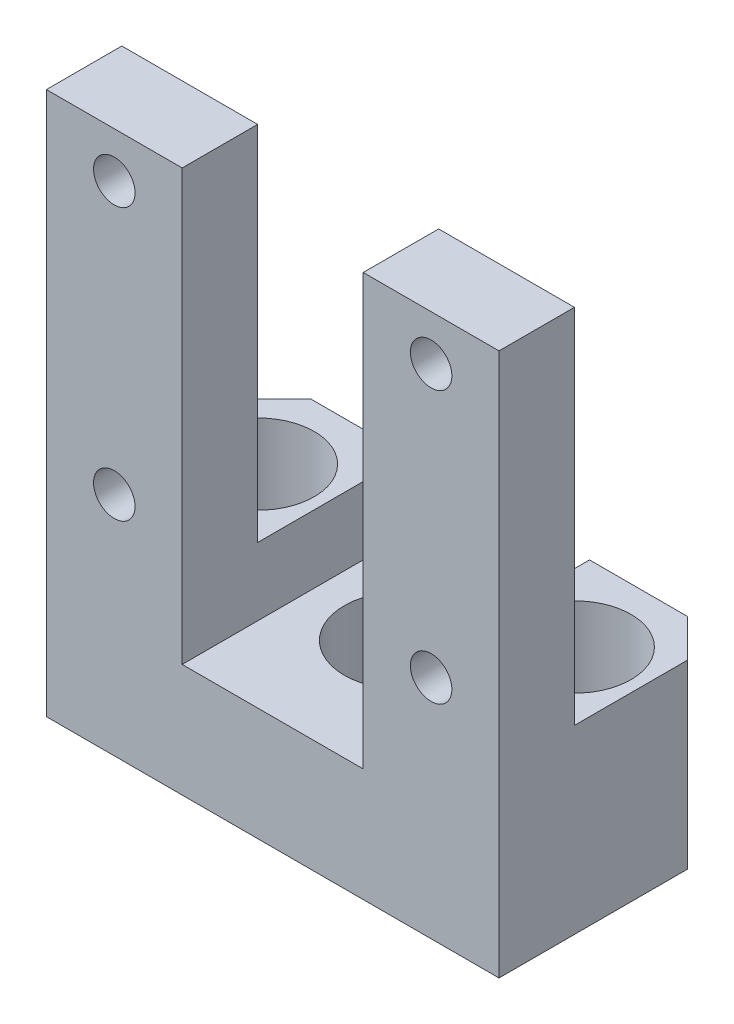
ISO-10303-21;
HEADER;
FILE_DESCRIPTION(('STEP AP214'),'2;1');
FILE_NAME('part.step','',(''),(''),'','','');
FILE_SCHEMA(('AUTOMOTIVE_DESIGN { 1 0 10303 214 1 1 1 1 }'));
ENDSEC;
DATA;
#1=APPLICATION_CONTEXT('core data for automotive mechanical design processes');
#2=APPLICATION_PROTOCOL_DEFINITION('international standard','automotive_design',2000,#1);
#3=PRODUCT_CONTEXT('',#1,'mechanical');
#4=PRODUCT('Part','Part','',(#3));
#5=PRODUCT_RELATED_PRODUCT_CATEGORY('part','',(#4));
#6=PRODUCT_DEFINITION_FORMATION('','',#4);
#7=PRODUCT_DEFINITION_CONTEXT('part definition',#1,'design');
#8=PRODUCT_DEFINITION('design','',#6,#7);
#9=PRODUCT_DEFINITION_SHAPE('','',#8);
#10=(LENGTH_UNIT() NAMED_UNIT(*) SI_UNIT(.MILLI.,.METRE.));
#11=(NAMED_UNIT(*) PLANE_ANGLE_UNIT() SI_UNIT($,.RADIAN.));
#12=(NAMED_UNIT(*) SI_UNIT($,.STERADIAN.) SOLID_ANGLE_UNIT());
#13=UNCERTAINTY_MEASURE_WITH_UNIT(LENGTH_MEASURE(1.E-05),#10,'distance_accuracy_value','');
#14=(GEOMETRIC_REPRESENTATION_CONTEXT(3) GLOBAL_UNCERTAINTY_ASSIGNED_CONTEXT((#13)) GLOBAL_UNIT_ASSIGNED_CONTEXT((#10,
#11,#12)) REPRESENTATION_CONTEXT('',''));
#15=CARTESIAN_POINT('',(0.,0.,0.));
#16=DIRECTION('',(0.,0.,1.));
#17=DIRECTION('',(1.,0.,0.));
#18=AXIS2_PLACEMENT_3D('',#15,#16,#17);
#19=CARTESIAN_POINT('',(21.,30.,12.5));
#20=DIRECTION('',(0.,0.,-1.));
#21=DIRECTION('',(0.,1.,0.));
#22=AXIS2_PLACEMENT_3D('',#19,#20,#21);
#23=CYLINDRICAL_SURFACE('',#22,5.);
#24=CARTESIAN_POINT('',(21.,30.,12.5));
#25=DIRECTION('',(0.,0.,-1.));
#26=DIRECTION('',(0.,1.,0.));
#27=AXIS2_PLACEMENT_3D('',#24,#25,#26);
#28=CIRCLE('',#27,5.);
#29=CARTESIAN_POINT('',(21.,35.,12.5));
#30=VERTEX_POINT('',#29);
#31=EDGE_CURVE('E603',#30,#30,#28,.T.);
#32=ORIENTED_EDGE('',*,*,#31,.F.);
#33=EDGE_LOOP('',(#32));
#34=FACE_BOUND('',#33,.T.);
#35=CARTESIAN_POINT('',(21.,30.,7.49999999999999));
#36=DIRECTION('',(0.,0.,-1.));
#37=DIRECTION('',(0.,1.,0.));
#38=AXIS2_PLACEMENT_3D('',#35,#36,#37);
#39=CIRCLE('',#38,5.);
#40=CARTESIAN_POINT('',(21.,35.,7.49999999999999));
#41=VERTEX_POINT('',#40);
#42=EDGE_CURVE('E610',#41,#41,#39,.T.);
#43=ORIENTED_EDGE('',*,*,#42,.T.);
#44=EDGE_LOOP('',(#43));
#45=FACE_BOUND('',#44,.T.);
#46=ADVANCED_FACE('F17',(#34,#45),#23,.F.);
#47=CARTESIAN_POINT('',(21.,66.,12.5));
#48=DIRECTION('',(0.,0.,-1.));
#49=DIRECTION('',(0.,1.,0.));
#50=AXIS2_PLACEMENT_3D('',#47,#48,#49);
#51=CYLINDRICAL_SURFACE('',#50,5.);
#52=CARTESIAN_POINT('',(21.,66.,12.5));
#53=DIRECTION('',(0.,0.,-1.));
#54=DIRECTION('',(0.,1.,0.));
#55=AXIS2_PLACEMENT_3D('',#52,#53,#54);
#56=CIRCLE('',#55,5.);
#57=CARTESIAN_POINT('',(21.,71.,12.5));
#58=VERTEX_POINT('',#57);
#59=EDGE_CURVE('E605',#58,#58,#56,.T.);
#60=ORIENTED_EDGE('',*,*,#59,.F.);
#61=EDGE_LOOP('',(#60));
#62=FACE_BOUND('',#61,.T.);
#63=CARTESIAN_POINT('',(21.,66.,7.5));
#64=DIRECTION('',(0.,0.,-1.));
#65=DIRECTION('',(0.,1.,0.));
#66=AXIS2_PLACEMENT_3D('',#63,#64,#65);
#67=CIRCLE('',#66,5.);
#68=CARTESIAN_POINT('',(21.,71.,7.5));
#69=VERTEX_POINT('',#68);
#70=EDGE_CURVE('E155',#69,#69,#67,.T.);
#71=ORIENTED_EDGE('',*,*,#70,.T.);
#72=EDGE_LOOP('',(#71));
#73=FACE_BOUND('',#72,.T.);
#74=ADVANCED_FACE('F244',(#62,#73),#51,.F.);
#75=CARTESIAN_POINT('',(21.,12.,-12.5));
#76=DIRECTION('',(0.,0.,-1.));
#77=DIRECTION('',(-1.,0.,0.));
#78=AXIS2_PLACEMENT_3D('',#75,#76,#77);
#79=CYLINDRICAL_SURFACE('',#78,1.65);
#80=CARTESIAN_POINT('',(21.,10.35,-9.));
#81=CARTESIAN_POINT('',(21.0914767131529,10.3500039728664,-8.99999786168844));
#82=CARTESIAN_POINT('',(21.1830077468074,10.3576347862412,-8.99830893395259));
#83=CARTESIAN_POINT('',(21.3634874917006,10.3879308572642,-8.99173252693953));
#84=CARTESIAN_POINT('',(21.4524335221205,10.4106111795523,-8.98684184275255));
#85=CARTESIAN_POINT('',(21.6250824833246,10.4702608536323,-8.97440674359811));
#86=CARTESIAN_POINT('',(21.7087913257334,10.507213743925,-8.96686538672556));
#87=CARTESIAN_POINT('',(21.8688098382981,10.5943082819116,-8.94994307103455));
#88=CARTESIAN_POINT('',(21.9451203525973,10.6444484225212,-8.94056232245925));
#89=CARTESIAN_POINT('',(22.0894219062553,10.7573522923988,-8.92081847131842));
#90=CARTESIAN_POINT('',(22.1572764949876,10.8202882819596,-8.91044311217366));
#91=CARTESIAN_POINT('',(22.2815709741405,10.9566455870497,-8.88996306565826));
#92=CARTESIAN_POINT('',(22.3380074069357,11.0300700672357,-8.87985846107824));
#93=CARTESIAN_POINT('',(22.4384710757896,11.1863469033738,-8.86094096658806));
#94=CARTESIAN_POINT('',(22.4823466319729,11.2692988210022,-8.85214443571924));
#95=CARTESIAN_POINT('',(22.5554385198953,11.4415691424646,-8.8370305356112));
#96=CARTESIAN_POINT('',(22.5846717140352,11.5308800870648,-8.83071031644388));
#97=CARTESIAN_POINT('',(22.6206823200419,11.6838780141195,-8.82281368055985));
#98=CARTESIAN_POINT('',(22.6316585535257,11.7465639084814,-8.82036523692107));
#99=CARTESIAN_POINT('',(22.6463186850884,11.8728244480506,-8.81708212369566));
#100=CARTESIAN_POINT('',(22.650002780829,11.9363990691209,-8.81624741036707));
#101=CARTESIAN_POINT('',(22.6499960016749,12.0914465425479,-8.81625138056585));
#102=CARTESIAN_POINT('',(22.642370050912,12.182947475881,-8.81798270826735));
#103=CARTESIAN_POINT('',(22.6120950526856,12.3633646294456,-8.82471024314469));
#104=CARTESIAN_POINT('',(22.5894308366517,12.4522781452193,-8.82970974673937));
#105=CARTESIAN_POINT('',(22.5298282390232,12.6248582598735,-8.84238018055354));
#106=CARTESIAN_POINT('',(22.4929070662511,12.7085310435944,-8.85004788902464));
#107=CARTESIAN_POINT('',(22.4058873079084,12.8684886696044,-8.86718660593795));
#108=CARTESIAN_POINT('',(22.355790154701,12.9447743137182,-8.87665741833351));
#109=CARTESIAN_POINT('',(22.2429305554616,13.0891019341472,-8.89651594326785));
#110=CARTESIAN_POINT('',(22.1799861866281,13.157000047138,-8.90691546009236));
#111=CARTESIAN_POINT('',(22.0435935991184,13.2813791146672,-8.92735880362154));
#112=CARTESIAN_POINT('',(21.9701423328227,13.3378567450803,-8.9374025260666));
#113=CARTESIAN_POINT('',(21.8138400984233,13.4383651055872,-8.95613323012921));
#114=CARTESIAN_POINT('',(21.7308941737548,13.4822512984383,-8.96480398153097));
#115=CARTESIAN_POINT('',(21.5586367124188,13.5553645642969,-8.97966356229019));
#116=CARTESIAN_POINT('',(21.4693325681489,13.5846083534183,-8.9858552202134));
#117=CARTESIAN_POINT('',(21.3163067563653,13.6206478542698,-8.99358442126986));
#118=CARTESIAN_POINT('',(21.2535837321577,13.6316370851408,-8.9959781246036));
#119=CARTESIAN_POINT('',(21.1272492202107,13.64631444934,-8.99918663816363));
#120=CARTESIAN_POINT('',(21.0636377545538,13.6500027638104,-9.0000014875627));
#121=CARTESIAN_POINT('',(20.9085232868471,13.6499960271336,-8.99999786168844));
#122=CARTESIAN_POINT('',(20.8169922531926,13.6423652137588,-8.99830893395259));
#123=CARTESIAN_POINT('',(20.6365125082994,13.6120691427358,-8.99173252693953));
#124=CARTESIAN_POINT('',(20.5475664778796,13.5893888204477,-8.98684184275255));
#125=CARTESIAN_POINT('',(20.3749175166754,13.5297391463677,-8.97440674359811));
#126=CARTESIAN_POINT('',(20.2912086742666,13.492786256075,-8.96686538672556));
#127=CARTESIAN_POINT('',(20.1311901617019,13.4056917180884,-8.94994307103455));
#128=CARTESIAN_POINT('',(20.0548796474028,13.3555515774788,-8.94056232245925));
#129=CARTESIAN_POINT('',(19.9105780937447,13.2426477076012,-8.92081847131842));
#130=CARTESIAN_POINT('',(19.8427235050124,13.1797117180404,-8.91044311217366));
#131=CARTESIAN_POINT('',(19.7184290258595,13.0433544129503,-8.88996306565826));
#132=CARTESIAN_POINT('',(19.6619925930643,12.9699299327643,-8.87985846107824));
#133=CARTESIAN_POINT('',(19.5615289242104,12.8136530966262,-8.86094096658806));
#134=CARTESIAN_POINT('',(19.5176533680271,12.7307011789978,-8.85214443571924));
#135=CARTESIAN_POINT('',(19.4445614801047,12.5584308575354,-8.8370305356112));
#136=CARTESIAN_POINT('',(19.4153282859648,12.4691199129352,-8.83071031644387));
#137=CARTESIAN_POINT('',(19.3793176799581,12.3161219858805,-8.82281368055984));
#138=CARTESIAN_POINT('',(19.3683414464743,12.2534360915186,-8.82036523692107));
#139=CARTESIAN_POINT('',(19.3536813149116,12.1271755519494,-8.81708212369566));
#140=CARTESIAN_POINT('',(19.349997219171,12.0636009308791,-8.81624741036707));
#141=CARTESIAN_POINT('',(19.3500039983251,11.9085534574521,-8.81625138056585));
#142=CARTESIAN_POINT('',(19.357629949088,11.817052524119,-8.81798270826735));
#143=CARTESIAN_POINT('',(19.3879049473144,11.6366353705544,-8.82471024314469));
#144=CARTESIAN_POINT('',(19.4105691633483,11.5477218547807,-8.82970974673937));
#145=CARTESIAN_POINT('',(19.4701717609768,11.3751417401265,-8.84238018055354));
#146=CARTESIAN_POINT('',(19.5070929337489,11.2914689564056,-8.85004788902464));
#147=CARTESIAN_POINT('',(19.5941126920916,11.1315113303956,-8.86718660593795));
#148=CARTESIAN_POINT('',(19.644209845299,11.0552256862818,-8.87665741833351));
#149=CARTESIAN_POINT('',(19.7570694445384,10.9108980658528,-8.89651594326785));
#150=CARTESIAN_POINT('',(19.8200138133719,10.842999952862,-8.90691546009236));
#151=CARTESIAN_POINT('',(19.9564064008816,10.7186208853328,-8.92735880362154));
#152=CARTESIAN_POINT('',(20.0298576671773,10.6621432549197,-8.9374025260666));
#153=CARTESIAN_POINT('',(20.1861599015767,10.5616348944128,-8.95613323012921));
#154=CARTESIAN_POINT('',(20.2691058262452,10.5177487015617,-8.96480398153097));
#155=CARTESIAN_POINT('',(20.4413632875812,10.4446354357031,-8.97966356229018));
#156=CARTESIAN_POINT('',(20.5306674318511,10.4153916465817,-8.9858552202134));
#157=CARTESIAN_POINT('',(20.6836932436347,10.3793521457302,-8.99358442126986));
#158=CARTESIAN_POINT('',(20.7464162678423,10.3683629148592,-8.9959781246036));
#159=CARTESIAN_POINT('',(20.8727507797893,10.35368555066,-8.99918663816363));
#160=CARTESIAN_POINT('',(20.9363622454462,10.3499972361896,-9.0000014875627));
#161=CARTESIAN_POINT('',(21.,10.35,-9.));
#162=B_SPLINE_CURVE_WITH_KNOTS('',3,(#80,#81,#82,#83,#84,#85,#86,#87,#88,#89,#90,#91,#92,#93,
#94,#95,#96,#97,#98,#99,#100,#101,#102,#103,#104,#105,#106,#107,#108,#109,#110,#111,#112,#113,
#114,#115,#116,#117,#118,#119,#120,#121,#122,#123,#124,#125,#126,#127,#128,#129,#130,#131,#132,
#133,#134,#135,#136,#137,#138,#139,#140,#141,#142,#143,#144,#145,#146,#147,#148,#149,#150,#151,
#152,#153,#154,#155,#156,#157,#158,#159,#160,#161),.UNSPECIFIED.,.T.,.F.,(4,2,2,2,2,2,2,2,2,2,2,
2,2,2,2,2,2,2,2,2,2,2,2,2,2,2,2,2,2,2,2,2,2,2,2,2,2,2,2,2,4),(0.,0.274195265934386,
0.548665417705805,0.822819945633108,1.09694315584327,1.37503526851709,1.6532114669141,
1.93461732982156,2.21569837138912,2.40634286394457,2.59698218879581,2.87108677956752,
3.14546827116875,3.41951960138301,3.69354115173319,3.97175205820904,4.25004382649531,
4.53141281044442,4.81245984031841,5.00321444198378,5.19396431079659,5.46815957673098,
5.7426297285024,6.0167842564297,6.29090746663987,6.56899957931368,6.8471757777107,
7.12858164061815,7.40966268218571,7.60030717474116,7.79094649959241,8.06505109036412,
8.33943258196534,8.61348391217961,8.88750546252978,9.16571636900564,9.44400813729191,
9.72537712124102,10.006424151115,10.1971787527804,10.3879286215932),.UNSPECIFIED.);
#163=CARTESIAN_POINT('',(21.,10.35,-9.));
#164=VERTEX_POINT('',#163);
#165=EDGE_CURVE('E154',#164,#164,#162,.T.);
#166=ORIENTED_EDGE('',*,*,#165,.T.);
#167=EDGE_LOOP('',(#166));
#168=FACE_BOUND('',#167,.T.);
#169=CARTESIAN_POINT('',(21.,12.,-12.5));
#170=DIRECTION('',(0.,0.,-1.));
#171=DIRECTION('',(-1.,0.,0.));
#172=AXIS2_PLACEMENT_3D('',#169,#170,#171);
#173=CIRCLE('',#172,1.65);
#174=CARTESIAN_POINT('',(19.35,12.,-12.5));
#175=VERTEX_POINT('',#174);
#176=EDGE_CURVE('E130',#175,#175,#173,.T.);
#177=ORIENTED_EDGE('',*,*,#176,.T.);
#178=EDGE_LOOP('',(#177));
#179=FACE_BOUND('',#178,.T.);
#180=ADVANCED_FACE('F241',(#168,#179),#79,.F.);
#181=CARTESIAN_POINT('',(-21.,12.,-12.5));
#182=DIRECTION('',(0.,0.,-1.));
#183=DIRECTION('',(-1.,0.,0.));
#184=AXIS2_PLACEMENT_3D('',#181,#182,#183);
#185=CYLINDRICAL_SURFACE('',#184,1.65);
#186=CARTESIAN_POINT('',(-21.,10.35,-9.));
#187=CARTESIAN_POINT('',(-20.9085232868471,10.3500039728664,-8.99999786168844));
#188=CARTESIAN_POINT('',(-20.8169922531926,10.3576347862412,-8.99830893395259));
#189=CARTESIAN_POINT('',(-20.6365125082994,10.3879308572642,-8.99173252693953));
#190=CARTESIAN_POINT('',(-20.5475664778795,10.4106111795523,-8.98684184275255));
#191=CARTESIAN_POINT('',(-20.3749175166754,10.4702608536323,-8.97440674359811));
#192=CARTESIAN_POINT('',(-20.2912086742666,10.507213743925,-8.96686538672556));
#193=CARTESIAN_POINT('',(-20.1311901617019,10.5943082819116,-8.94994307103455));
#194=CARTESIAN_POINT('',(-20.0548796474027,10.6444484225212,-8.94056232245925));
#195=CARTESIAN_POINT('',(-19.9105780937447,10.7573522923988,-8.92081847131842));
#196=CARTESIAN_POINT('',(-19.8427235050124,10.8202882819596,-8.91044311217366));
#197=CARTESIAN_POINT('',(-19.7184290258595,10.9566455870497,-8.88996306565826));
#198=CARTESIAN_POINT('',(-19.6619925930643,11.0300700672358,-8.87985846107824));
#199=CARTESIAN_POINT('',(-19.5615289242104,11.1863469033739,-8.86094096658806));
#200=CARTESIAN_POINT('',(-19.5176533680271,11.2692988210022,-8.85214443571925));
#201=CARTESIAN_POINT('',(-19.4445614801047,11.4415691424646,-8.8370305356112));
#202=CARTESIAN_POINT('',(-19.4153282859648,11.5308800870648,-8.83071031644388));
#203=CARTESIAN_POINT('',(-19.3793176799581,11.6838780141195,-8.82281368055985));
#204=CARTESIAN_POINT('',(-19.3683414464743,11.7465639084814,-8.82036523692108));
#205=CARTESIAN_POINT('',(-19.3536813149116,11.8728244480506,-8.81708212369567));
#206=CARTESIAN_POINT('',(-19.349997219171,11.9363990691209,-8.81624741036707));
#207=CARTESIAN_POINT('',(-19.3500039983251,12.0914465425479,-8.81625138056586));
#208=CARTESIAN_POINT('',(-19.357629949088,12.182947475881,-8.81798270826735));
#209=CARTESIAN_POINT('',(-19.3879049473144,12.3633646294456,-8.82471024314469));
#210=CARTESIAN_POINT('',(-19.4105691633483,12.4522781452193,-8.82970974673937));
#211=CARTESIAN_POINT('',(-19.4701717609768,12.6248582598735,-8.84238018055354));
#212=CARTESIAN_POINT('',(-19.5070929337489,12.7085310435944,-8.85004788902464));
#213=CARTESIAN_POINT('',(-19.5941126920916,12.8684886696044,-8.86718660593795));
#214=CARTESIAN_POINT('',(-19.644209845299,12.9447743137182,-8.87665741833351));
#215=CARTESIAN_POINT('',(-19.7570694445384,13.0891019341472,-8.89651594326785));
#216=CARTESIAN_POINT('',(-19.8200138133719,13.157000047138,-8.90691546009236));
#217=CARTESIAN_POINT('',(-19.9564064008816,13.2813791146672,-8.92735880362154));
#218=CARTESIAN_POINT('',(-20.0298576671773,13.3378567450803,-8.9374025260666));
#219=CARTESIAN_POINT('',(-20.1861599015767,13.4383651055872,-8.95613323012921));
#220=CARTESIAN_POINT('',(-20.2691058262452,13.4822512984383,-8.96480398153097));
#221=CARTESIAN_POINT('',(-20.4413632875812,13.5553645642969,-8.97966356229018));
#222=CARTESIAN_POINT('',(-20.5306674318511,13.5846083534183,-8.9858552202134));
#223=CARTESIAN_POINT('',(-20.6836932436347,13.6206478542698,-8.99358442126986));
#224=CARTESIAN_POINT('',(-20.7464162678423,13.6316370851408,-8.9959781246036));
#225=CARTESIAN_POINT('',(-20.8727507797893,13.64631444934,-8.99918663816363));
#226=CARTESIAN_POINT('',(-20.9363622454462,13.6500027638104,-9.0000014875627));
#227=CARTESIAN_POINT('',(-21.0914767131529,13.6499960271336,-8.99999786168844));
#228=CARTESIAN_POINT('',(-21.1830077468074,13.6423652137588,-8.99830893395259));
#229=CARTESIAN_POINT('',(-21.3634874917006,13.6120691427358,-8.99173252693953));
#230=CARTESIAN_POINT('',(-21.4524335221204,13.5893888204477,-8.98684184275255));
#231=CARTESIAN_POINT('',(-21.6250824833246,13.5297391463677,-8.97440674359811));
#232=CARTESIAN_POINT('',(-21.7087913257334,13.492786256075,-8.96686538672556));
#233=CARTESIAN_POINT('',(-21.8688098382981,13.4056917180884,-8.94994307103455));
#234=CARTESIAN_POINT('',(-21.9451203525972,13.3555515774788,-8.94056232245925));
#235=CARTESIAN_POINT('',(-22.0894219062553,13.2426477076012,-8.92081847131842));
#236=CARTESIAN_POINT('',(-22.1572764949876,13.1797117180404,-8.91044311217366));
#237=CARTESIAN_POINT('',(-22.2815709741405,13.0433544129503,-8.88996306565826));
#238=CARTESIAN_POINT('',(-22.3380074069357,12.9699299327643,-8.87985846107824));
#239=CARTESIAN_POINT('',(-22.4384710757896,12.8136530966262,-8.86094096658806));
#240=CARTESIAN_POINT('',(-22.4823466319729,12.7307011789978,-8.85214443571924));
#241=CARTESIAN_POINT('',(-22.5554385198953,12.5584308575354,-8.8370305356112));
#242=CARTESIAN_POINT('',(-22.5846717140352,12.4691199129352,-8.83071031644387));
#243=CARTESIAN_POINT('',(-22.6206823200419,12.3161219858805,-8.82281368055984));
#244=CARTESIAN_POINT('',(-22.6316585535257,12.2534360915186,-8.82036523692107));
#245=CARTESIAN_POINT('',(-22.6463186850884,12.1271755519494,-8.81708212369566));
#246=CARTESIAN_POINT('',(-22.650002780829,12.0636009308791,-8.81624741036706));
#247=CARTESIAN_POINT('',(-22.6499960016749,11.9085534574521,-8.81625138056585));
#248=CARTESIAN_POINT('',(-22.642370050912,11.817052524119,-8.81798270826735));
#249=CARTESIAN_POINT('',(-22.6120950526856,11.6366353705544,-8.82471024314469));
#250=CARTESIAN_POINT('',(-22.5894308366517,11.5477218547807,-8.82970974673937));
#251=CARTESIAN_POINT('',(-22.5298282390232,11.3751417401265,-8.84238018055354));
#252=CARTESIAN_POINT('',(-22.4929070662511,11.2914689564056,-8.85004788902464));
#253=CARTESIAN_POINT('',(-22.4058873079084,11.1315113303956,-8.86718660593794));
#254=CARTESIAN_POINT('',(-22.355790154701,11.0552256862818,-8.87665741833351));
#255=CARTESIAN_POINT('',(-22.2429305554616,10.9108980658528,-8.89651594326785));
#256=CARTESIAN_POINT('',(-22.1799861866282,10.842999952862,-8.90691546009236));
#257=CARTESIAN_POINT('',(-22.0435935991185,10.7186208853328,-8.92735880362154));
#258=CARTESIAN_POINT('',(-21.9701423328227,10.6621432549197,-8.9374025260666));
#259=CARTESIAN_POINT('',(-21.8138400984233,10.5616348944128,-8.95613323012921));
#260=CARTESIAN_POINT('',(-21.7308941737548,10.5177487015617,-8.96480398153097));
#261=CARTESIAN_POINT('',(-21.5586367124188,10.4446354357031,-8.97966356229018));
#262=CARTESIAN_POINT('',(-21.4693325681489,10.4153916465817,-8.9858552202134));
#263=CARTESIAN_POINT('',(-21.3163067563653,10.3793521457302,-8.99358442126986));
#264=CARTESIAN_POINT('',(-21.2535837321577,10.3683629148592,-8.9959781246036));
#265=CARTESIAN_POINT('',(-21.1272492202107,10.35368555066,-8.99918663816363));
#266=CARTESIAN_POINT('',(-21.0636377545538,10.3499972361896,-9.0000014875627));
#267=CARTESIAN_POINT('',(-21.,10.35,-9.));
#268=B_SPLINE_CURVE_WITH_KNOTS('',3,(#186,#187,#188,#189,#190,#191,#192,#193,#194,#195,#196,
#197,#198,#199,#200,#201,#202,#203,#204,#205,#206,#207,#208,#209,#210,#211,#212,#213,#214,#215,
#216,#217,#218,#219,#220,#221,#222,#223,#224,#225,#226,#227,#228,#229,#230,#231,#232,#233,#234,
#235,#236,#237,#238,#239,#240,#241,#242,#243,#244,#245,#246,#247,#248,#249,#250,#251,#252,#253,
#254,#255,#256,#257,#258,#259,#260,#261,#262,#263,#264,#265,#266,#267),.UNSPECIFIED.,.T.,.F.,(4,
2,2,2,2,2,2,2,2,2,2,2,2,2,2,2,2,2,2,2,2,2,2,2,2,2,2,2,2,2,2,2,2,2,2,2,2,2,2,2,4),(0.,
0.274195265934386,0.548665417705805,0.822819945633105,1.09694315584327,1.37503526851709,
1.6532114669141,1.93461732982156,2.21569837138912,2.40634286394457,2.59698218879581,
2.87108677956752,3.14546827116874,3.419519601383,3.69354115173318,3.97175205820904,
4.25004382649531,4.53141281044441,4.81245984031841,5.00321444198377,5.19396431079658,
5.46815957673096,5.74262972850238,6.01678425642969,6.29090746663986,6.56899957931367,
6.84717577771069,7.12858164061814,7.4096626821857,7.60030717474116,7.7909464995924,
8.06505109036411,8.33943258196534,8.6134839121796,8.88750546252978,9.16571636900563,
9.4440081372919,9.72537712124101,10.006424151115,10.1971787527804,10.3879286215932),.UNSPECIFIED.);
#269=CARTESIAN_POINT('',(-21.,10.35,-9.));
#270=VERTEX_POINT('',#269);
#271=EDGE_CURVE('E131',#270,#270,#268,.T.);
#272=ORIENTED_EDGE('',*,*,#271,.T.);
#273=EDGE_LOOP('',(#272));
#274=FACE_BOUND('',#273,.T.);
#275=CARTESIAN_POINT('',(-21.,12.,-12.5));
#276=DIRECTION('',(0.,0.,-1.));
#277=DIRECTION('',(-1.,0.,0.));
#278=AXIS2_PLACEMENT_3D('',#275,#276,#277);
#279=CIRCLE('',#278,1.65);
#280=CARTESIAN_POINT('',(-22.65,12.,-12.5));
#281=VERTEX_POINT('',#280);
#282=EDGE_CURVE('E146',#281,#281,#279,.T.);
#283=ORIENTED_EDGE('',*,*,#282,.T.);
#284=EDGE_LOOP('',(#283));
#285=FACE_BOUND('',#284,.T.);
#286=ADVANCED_FACE('F218',(#274,#285),#185,.F.);
#287=CARTESIAN_POINT('',(-21.,66.,12.5));
#288=DIRECTION('',(0.,0.,-1.));
#289=DIRECTION('',(0.,1.,0.));
#290=AXIS2_PLACEMENT_3D('',#287,#288,#289);
#291=CYLINDRICAL_SURFACE('',#290,5.);
#292=CARTESIAN_POINT('',(-21.,66.,12.5));
#293=DIRECTION('',(0.,0.,-1.));
#294=DIRECTION('',(0.,1.,0.));
#295=AXIS2_PLACEMENT_3D('',#292,#293,#294);
#296=CIRCLE('',#295,5.);
#297=CARTESIAN_POINT('',(-21.,71.,12.5));
#298=VERTEX_POINT('',#297);
#299=EDGE_CURVE('E599',#298,#298,#296,.T.);
#300=ORIENTED_EDGE('',*,*,#299,.F.);
#301=EDGE_LOOP('',(#300));
#302=FACE_BOUND('',#301,.T.);
#303=CARTESIAN_POINT('',(-21.,66.,7.5));
#304=DIRECTION('',(0.,0.,-1.));
#305=DIRECTION('',(0.,1.,0.));
#306=AXIS2_PLACEMENT_3D('',#303,#304,#305);
#307=CIRCLE('',#306,5.);
#308=CARTESIAN_POINT('',(-21.,71.,7.5));
#309=VERTEX_POINT('',#308);
#310=EDGE_CURVE('E140',#309,#309,#307,.T.);
#311=ORIENTED_EDGE('',*,*,#310,.T.);
#312=EDGE_LOOP('',(#311));
#313=FACE_BOUND('',#312,.T.);
#314=ADVANCED_FACE('F397',(#302,#313),#291,.F.);
#315=CARTESIAN_POINT('',(-21.,30.,12.5));
#316=DIRECTION('',(0.,0.,-1.));
#317=DIRECTION('',(0.,1.,0.));
#318=AXIS2_PLACEMENT_3D('',#315,#316,#317);
#319=CYLINDRICAL_SURFACE('',#318,5.);
#320=CARTESIAN_POINT('',(-21.,30.,12.5));
#321=DIRECTION('',(0.,0.,-1.));
#322=DIRECTION('',(0.,1.,0.));
#323=AXIS2_PLACEMENT_3D('',#320,#321,#322);
#324=CIRCLE('',#323,5.);
#325=CARTESIAN_POINT('',(-21.,35.,12.5));
#326=VERTEX_POINT('',#325);
#327=EDGE_CURVE('E20',#326,#326,#324,.T.);
#328=ORIENTED_EDGE('',*,*,#327,.F.);
#329=EDGE_LOOP('',(#328));
#330=FACE_BOUND('',#329,.T.);
#331=CARTESIAN_POINT('',(-21.,30.,7.49999999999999));
#332=DIRECTION('',(0.,0.,-1.));
#333=DIRECTION('',(0.,1.,0.));
#334=AXIS2_PLACEMENT_3D('',#331,#332,#333);
#335=CIRCLE('',#334,5.);
#336=CARTESIAN_POINT('',(-21.,35.,7.49999999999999));
#337=VERTEX_POINT('',#336);
#338=EDGE_CURVE('E203',#337,#337,#335,.T.);
#339=ORIENTED_EDGE('',*,*,#338,.T.);
#340=EDGE_LOOP('',(#339));
#341=FACE_BOUND('',#340,.T.);
#342=ADVANCED_FACE('F389',(#330,#341),#319,.F.);
#343=CARTESIAN_POINT('',(-21.,30.,12.5));
#344=DIRECTION('',(0.,0.,-1.));
#345=DIRECTION('',(0.,1.,0.));
#346=AXIS2_PLACEMENT_3D('',#343,#344,#345);
#347=PLANE('',#346);
#348=CARTESIAN_POINT('',(-21.,30.,12.5));
#349=DIRECTION('',(0.,0.,-1.));
#350=DIRECTION('',(0.,1.,0.));
#351=AXIS2_PLACEMENT_3D('',#348,#349,#350);
#352=CIRCLE('',#351,2.75);
#353=CARTESIAN_POINT('',(-21.,32.75,12.5));
#354=VERTEX_POINT('',#353);
#355=EDGE_CURVE('E196',#354,#354,#352,.F.);
#356=ORIENTED_EDGE('',*,*,#355,.T.);
#357=EDGE_LOOP('',(#356));
#358=FACE_BOUND('',#357,.T.);
#359=ORIENTED_EDGE('',*,*,#327,.T.);
#360=EDGE_LOOP('',(#359));
#361=FACE_BOUND('',#360,.T.);
#362=ADVANCED_FACE('F381',(#358,#361),#347,.T.);
#363=CARTESIAN_POINT('',(-21.,66.,12.5));
#364=DIRECTION('',(0.,0.,-1.));
#365=DIRECTION('',(0.,1.,0.));
#366=AXIS2_PLACEMENT_3D('',#363,#364,#365);
#367=PLANE('',#366);
#368=CARTESIAN_POINT('',(-21.,66.,12.5));
#369=DIRECTION('',(0.,0.,-1.));
#370=DIRECTION('',(0.,1.,0.));
#371=AXIS2_PLACEMENT_3D('',#368,#369,#370);
#372=CIRCLE('',#371,2.75);
#373=CARTESIAN_POINT('',(-21.,68.75,12.5));
#374=VERTEX_POINT('',#373);
#375=EDGE_CURVE('E193',#374,#374,#372,.F.);
#376=ORIENTED_EDGE('',*,*,#375,.T.);
#377=EDGE_LOOP('',(#376));
#378=FACE_BOUND('',#377,.T.);
#379=ORIENTED_EDGE('',*,*,#299,.T.);
#380=EDGE_LOOP('',(#379));
#381=FACE_BOUND('',#380,.T.);
#382=ADVANCED_FACE('F373',(#378,#381),#367,.T.);
#383=CARTESIAN_POINT('',(21.,30.,12.5));
#384=DIRECTION('',(0.,0.,-1.));
#385=DIRECTION('',(0.,1.,0.));
#386=AXIS2_PLACEMENT_3D('',#383,#384,#385);
#387=PLANE('',#386);
#388=CARTESIAN_POINT('',(21.,30.,12.5));
#389=DIRECTION('',(0.,0.,-1.));
#390=DIRECTION('',(0.,1.,0.));
#391=AXIS2_PLACEMENT_3D('',#388,#389,#390);
#392=CIRCLE('',#391,2.75);
#393=CARTESIAN_POINT('',(21.,32.75,12.5));
#394=VERTEX_POINT('',#393);
#395=EDGE_CURVE('E190',#394,#394,#392,.F.);
#396=ORIENTED_EDGE('',*,*,#395,.T.);
#397=EDGE_LOOP('',(#396));
#398=FACE_BOUND('',#397,.T.);
#399=ORIENTED_EDGE('',*,*,#31,.T.);
#400=EDGE_LOOP('',(#399));
#401=FACE_BOUND('',#400,.T.);
#402=ADVANCED_FACE('F365',(#398,#401),#387,.T.);
#403=CARTESIAN_POINT('',(21.,66.,12.5));
#404=DIRECTION('',(0.,0.,-1.));
#405=DIRECTION('',(0.,1.,0.));
#406=AXIS2_PLACEMENT_3D('',#403,#404,#405);
#407=PLANE('',#406);
#408=CARTESIAN_POINT('',(21.,66.,12.5));
#409=DIRECTION('',(0.,0.,-1.));
#410=DIRECTION('',(0.,1.,0.));
#411=AXIS2_PLACEMENT_3D('',#408,#409,#410);
#412=CIRCLE('',#411,2.75);
#413=CARTESIAN_POINT('',(21.,68.75,12.5));
#414=VERTEX_POINT('',#413);
#415=EDGE_CURVE('E186',#414,#414,#412,.F.);
#416=ORIENTED_EDGE('',*,*,#415,.T.);
#417=EDGE_LOOP('',(#416));
#418=FACE_BOUND('',#417,.T.);
#419=ORIENTED_EDGE('',*,*,#59,.T.);
#420=EDGE_LOOP('',(#419));
#421=FACE_BOUND('',#420,.T.);
#422=ADVANCED_FACE('F357',(#418,#421),#407,.T.);
#423=CARTESIAN_POINT('',(-30.,72.,7.5));
#424=DIRECTION('',(0.,0.,1.));
#425=DIRECTION('',(0.,-1.,0.));
#426=AXIS2_PLACEMENT_3D('',#423,#424,#425);
#427=PLANE('',#426);
#428=DIRECTION('',(0.,1.,0.));
#429=VECTOR('',#428,1.);
#430=CARTESIAN_POINT('',(30.,72.,7.5));
#431=LINE('',#430,#429);
#432=CARTESIAN_POINT('',(30.,72.,7.5));
#433=VERTEX_POINT('',#432);
#434=CARTESIAN_POINT('',(30.,24.,7.5));
#435=VERTEX_POINT('',#434);
#436=EDGE_CURVE('E636',#433,#435,#431,.F.);
#437=ORIENTED_EDGE('',*,*,#436,.T.);
#438=DIRECTION('',(1.,0.,0.));
#439=VECTOR('',#438,1.);
#440=CARTESIAN_POINT('',(-30.,24.,7.49999999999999));
#441=LINE('',#440,#439);
#442=CARTESIAN_POINT('',(12.,24.,7.49999999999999));
#443=VERTEX_POINT('',#442);
#444=EDGE_CURVE('E152',#435,#443,#441,.F.);
#445=ORIENTED_EDGE('',*,*,#444,.T.);
#446=DIRECTION('',(0.,1.,0.));
#447=VECTOR('',#446,1.);
#448=CARTESIAN_POINT('',(12.,129.,7.49999999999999));
#449=LINE('',#448,#447);
#450=CARTESIAN_POINT('',(12.,72.,7.5));
#451=VERTEX_POINT('',#450);
#452=EDGE_CURVE('E650',#443,#451,#449,.T.);
#453=ORIENTED_EDGE('',*,*,#452,.T.);
#454=DIRECTION('',(1.,0.,0.));
#455=VECTOR('',#454,1.);
#456=CARTESIAN_POINT('',(0.,72.,7.5));
#457=LINE('',#456,#455);
#458=EDGE_CURVE('E639',#433,#451,#457,.F.);
#459=ORIENTED_EDGE('',*,*,#458,.F.);
#460=EDGE_LOOP('',(#437,#445,#453,#459));
#461=FACE_BOUND('',#460,.T.);
#462=ORIENTED_EDGE('',*,*,#70,.F.);
#463=EDGE_LOOP('',(#462));
#464=FACE_BOUND('',#463,.T.);
#465=ORIENTED_EDGE('',*,*,#42,.F.);
#466=EDGE_LOOP('',(#465));
#467=FACE_BOUND('',#466,.T.);
#468=ADVANCED_FACE('F350',(#461,#464,#467),#427,.F.);
#469=CARTESIAN_POINT('',(-30.,24.,-12.5));
#470=DIRECTION('',(0.,-1.,0.));
#471=DIRECTION('',(0.,0.,-1.));
#472=AXIS2_PLACEMENT_3D('',#469,#470,#471);
#473=PLANE('',#472);
#474=CARTESIAN_POINT('',(21.,24.,-1.5));
#475=DIRECTION('',(0.,1.,0.));
#476=DIRECTION('',(0.,0.,1.));
#477=AXIS2_PLACEMENT_3D('',#474,#475,#476);
#478=CIRCLE('',#477,7.5);
#479=CARTESIAN_POINT('',(21.,24.,6.));
#480=VERTEX_POINT('',#479);
#481=EDGE_CURVE('E216',#480,#480,#478,.F.);
#482=ORIENTED_EDGE('',*,*,#481,.T.);
#483=EDGE_LOOP('',(#482));
#484=FACE_BOUND('',#483,.T.);
#485=DIRECTION('',(0.707106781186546,0.,0.707106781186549));
#486=VECTOR('',#485,1.);
#487=CARTESIAN_POINT('',(25.,24.,-12.5));
#488=LINE('',#487,#486);
#489=CARTESIAN_POINT('',(30.,24.,-7.49999999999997));
#490=VERTEX_POINT('',#489);
#491=CARTESIAN_POINT('',(25.,24.,-12.5));
#492=VERTEX_POINT('',#491);
#493=EDGE_CURVE('E119',#490,#492,#488,.F.);
#494=ORIENTED_EDGE('',*,*,#493,.T.);
#495=DIRECTION('',(1.,0.,0.));
#496=VECTOR('',#495,1.);
#497=CARTESIAN_POINT('',(-30.,24.,-12.5));
#498=LINE('',#497,#496);
#499=CARTESIAN_POINT('',(12.,24.,-12.5));
#500=VERTEX_POINT('',#499);
#501=EDGE_CURVE('E123',#492,#500,#498,.F.);
#502=ORIENTED_EDGE('',*,*,#501,.T.);
#503=DIRECTION('',(0.,0.,-1.));
#504=VECTOR('',#503,1.);
#505=CARTESIAN_POINT('',(12.,24.,-12.5));
#506=LINE('',#505,#504);
#507=EDGE_CURVE('E652',#500,#443,#506,.F.);
#508=ORIENTED_EDGE('',*,*,#507,.T.);
#509=ORIENTED_EDGE('',*,*,#444,.F.);
#510=DIRECTION('',(0.,0.,1.));
#511=VECTOR('',#510,1.);
#512=CARTESIAN_POINT('',(30.,24.,-12.5));
#513=LINE('',#512,#511);
#514=EDGE_CURVE('E126',#435,#490,#513,.F.);
#515=ORIENTED_EDGE('',*,*,#514,.T.);
#516=EDGE_LOOP('',(#494,#502,#508,#509,#515));
#517=FACE_BOUND('',#516,.T.);
#518=ADVANCED_FACE('F121',(#484,#517),#473,.F.);
#519=CARTESIAN_POINT('',(0.,0.,0.));
#520=DIRECTION('',(0.,1.,0.));
#521=DIRECTION('',(0.,0.,1.));
#522=AXIS2_PLACEMENT_3D('',#519,#520,#521);
#523=CYLINDRICAL_SURFACE('',#522,8.);
#524=CARTESIAN_POINT('',(0.,0.,0.));
#525=DIRECTION('',(0.,1.,0.));
#526=DIRECTION('',(0.,0.,1.));
#527=AXIS2_PLACEMENT_3D('',#524,#525,#526);
#528=CIRCLE('',#527,8.);
#529=CARTESIAN_POINT('',(0.,0.,8.));
#530=VERTEX_POINT('',#529);
#531=EDGE_CURVE('E177',#530,#530,#528,.F.);
#532=ORIENTED_EDGE('',*,*,#531,.T.);
#533=EDGE_LOOP('',(#532));
#534=FACE_BOUND('',#533,.T.);
#535=CARTESIAN_POINT('',(0.,15.,0.));
#536=DIRECTION('',(0.,1.,0.));
#537=DIRECTION('',(0.,0.,1.));
#538=AXIS2_PLACEMENT_3D('',#535,#536,#537);
#539=CIRCLE('',#538,8.);
#540=CARTESIAN_POINT('',(0.,15.,8.));
#541=VERTEX_POINT('',#540);
#542=EDGE_CURVE('E181',#541,#541,#539,.T.);
#543=ORIENTED_EDGE('',*,*,#542,.T.);
#544=EDGE_LOOP('',(#543));
#545=FACE_BOUND('',#544,.T.);
#546=ADVANCED_FACE('F233',(#534,#545),#523,.F.);
#547=CARTESIAN_POINT('',(21.,0.,-1.5));
#548=DIRECTION('',(0.,1.,0.));
#549=DIRECTION('',(0.,0.,1.));
#550=AXIS2_PLACEMENT_3D('',#547,#548,#549);
#551=CYLINDRICAL_SURFACE('',#550,7.5);
#552=ORIENTED_EDGE('',*,*,#481,.F.);
#553=EDGE_LOOP('',(#552));
#554=FACE_BOUND('',#553,.T.);
#555=CARTESIAN_POINT('',(21.,0.,-1.5));
#556=DIRECTION('',(0.,1.,0.));
#557=DIRECTION('',(0.,0.,1.));
#558=AXIS2_PLACEMENT_3D('',#555,#556,#557);
#559=CIRCLE('',#558,7.5);
#560=CARTESIAN_POINT('',(21.,0.,6.));
#561=VERTEX_POINT('',#560);
#562=EDGE_CURVE('E174',#561,#561,#559,.F.);
#563=ORIENTED_EDGE('',*,*,#562,.T.);
#564=EDGE_LOOP('',(#563));
#565=FACE_BOUND('',#564,.T.);
#566=ORIENTED_EDGE('',*,*,#165,.F.);
#567=EDGE_LOOP('',(#566));
#568=FACE_BOUND('',#567,.T.);
#569=ADVANCED_FACE('F227',(#554,#565,#568),#551,.F.);
#570=CARTESIAN_POINT('',(-21.,0.,-1.5));
#571=DIRECTION('',(0.,1.,0.));
#572=DIRECTION('',(0.,0.,1.));
#573=AXIS2_PLACEMENT_3D('',#570,#571,#572);
#574=CYLINDRICAL_SURFACE('',#573,7.5);
#575=CARTESIAN_POINT('',(-21.,24.,-1.5));
#576=DIRECTION('',(0.,1.,0.));
#577=DIRECTION('',(0.,0.,1.));
#578=AXIS2_PLACEMENT_3D('',#575,#576,#577);
#579=CIRCLE('',#578,7.5);
#580=CARTESIAN_POINT('',(-21.,24.,6.));
#581=VERTEX_POINT('',#580);
#582=EDGE_CURVE('E199',#581,#581,#579,.T.);
#583=ORIENTED_EDGE('',*,*,#582,.T.);
#584=EDGE_LOOP('',(#583));
#585=FACE_BOUND('',#584,.T.);
#586=CARTESIAN_POINT('',(-21.,0.,-1.5));
#587=DIRECTION('',(0.,1.,0.));
#588=DIRECTION('',(0.,0.,1.));
#589=AXIS2_PLACEMENT_3D('',#586,#587,#588);
#590=CIRCLE('',#589,7.5);
#591=CARTESIAN_POINT('',(-21.,0.,6.));
#592=VERTEX_POINT('',#591);
#593=EDGE_CURVE('E170',#592,#592,#590,.F.);
#594=ORIENTED_EDGE('',*,*,#593,.T.);
#595=EDGE_LOOP('',(#594));
#596=FACE_BOUND('',#595,.T.);
#597=ORIENTED_EDGE('',*,*,#271,.F.);
#598=EDGE_LOOP('',(#597));
#599=FACE_BOUND('',#598,.T.);
#600=ADVANCED_FACE('F222',(#585,#596,#599),#574,.F.);
#601=CARTESIAN_POINT('',(25.,72.,-12.5));
#602=DIRECTION('',(-0.707106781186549,0.,0.707106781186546));
#603=DIRECTION('',(0.707106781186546,0.,0.707106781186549));
#604=AXIS2_PLACEMENT_3D('',#601,#602,#603);
#605=PLANE('',#604);
#606=DIRECTION('',(0.,1.,0.));
#607=VECTOR('',#606,1.);
#608=CARTESIAN_POINT('',(30.,72.,-7.49999999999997));
#609=LINE('',#608,#607);
#610=CARTESIAN_POINT('',(30.,0.,-7.49999999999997));
#611=VERTEX_POINT('',#610);
#612=EDGE_CURVE('E180',#490,#611,#609,.F.);
#613=ORIENTED_EDGE('',*,*,#612,.T.);
#614=DIRECTION('',(-0.707106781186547,0.,-0.707106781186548));
#615=VECTOR('',#614,1.);
#616=CARTESIAN_POINT('',(30.,0.,-7.49999999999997));
#617=LINE('',#616,#615);
#618=CARTESIAN_POINT('',(25.,0.,-12.5));
#619=VERTEX_POINT('',#618);
#620=EDGE_CURVE('E145',#611,#619,#617,.T.);
#621=ORIENTED_EDGE('',*,*,#620,.T.);
#622=DIRECTION('',(0.,1.,0.));
#623=VECTOR('',#622,1.);
#624=CARTESIAN_POINT('',(25.,72.,-12.5));
#625=LINE('',#624,#623);
#626=EDGE_CURVE('E136',#619,#492,#625,.T.);
#627=ORIENTED_EDGE('',*,*,#626,.T.);
#628=ORIENTED_EDGE('',*,*,#493,.F.);
#629=EDGE_LOOP('',(#613,#621,#627,#628));
#630=FACE_BOUND('',#629,.T.);
#631=ADVANCED_FACE('F143',(#630),#605,.F.);
#632=CARTESIAN_POINT('',(-30.,72.,-12.5));
#633=DIRECTION('',(0.,0.,1.));
#634=DIRECTION('',(1.,0.,0.));
#635=AXIS2_PLACEMENT_3D('',#632,#633,#634);
#636=PLANE('',#635);
#637=DIRECTION('',(0.,1.,0.));
#638=VECTOR('',#637,1.);
#639=CARTESIAN_POINT('',(-25.,72.,-12.5));
#640=LINE('',#639,#638);
#641=CARTESIAN_POINT('',(-25.,0.,-12.5));
#642=VERTEX_POINT('',#641);
#643=CARTESIAN_POINT('',(-25.,24.,-12.5));
#644=VERTEX_POINT('',#643);
#645=EDGE_CURVE('E114',#642,#644,#640,.T.);
#646=ORIENTED_EDGE('',*,*,#645,.T.);
#647=DIRECTION('',(1.,0.,0.));
#648=VECTOR('',#647,1.);
#649=CARTESIAN_POINT('',(-30.,24.,-12.5));
#650=LINE('',#649,#648);
#651=CARTESIAN_POINT('',(-12.,24.,-12.5));
#652=VERTEX_POINT('',#651);
#653=EDGE_CURVE('E202',#644,#652,#650,.T.);
#654=ORIENTED_EDGE('',*,*,#653,.T.);
#655=DIRECTION('',(0.,1.,0.));
#656=VECTOR('',#655,1.);
#657=CARTESIAN_POINT('',(-12.,129.,-12.5));
#658=LINE('',#657,#656);
#659=CARTESIAN_POINT('',(-12.,15.,-12.5));
#660=VERTEX_POINT('',#659);
#661=EDGE_CURVE('E185',#652,#660,#658,.F.);
#662=ORIENTED_EDGE('',*,*,#661,.T.);
#663=DIRECTION('',(1.,0.,0.));
#664=VECTOR('',#663,1.);
#665=CARTESIAN_POINT('',(-12.,15.,-12.5));
#666=LINE('',#665,#664);
#667=CARTESIAN_POINT('',(12.,15.,-12.5));
#668=VERTEX_POINT('',#667);
#669=EDGE_CURVE('E184',#660,#668,#666,.T.);
#670=ORIENTED_EDGE('',*,*,#669,.T.);
#671=DIRECTION('',(0.,1.,0.));
#672=VECTOR('',#671,1.);
#673=CARTESIAN_POINT('',(12.,129.,-12.5));
#674=LINE('',#673,#672);
#675=EDGE_CURVE('E139',#668,#500,#674,.T.);
#676=ORIENTED_EDGE('',*,*,#675,.T.);
#677=ORIENTED_EDGE('',*,*,#501,.F.);
#678=ORIENTED_EDGE('',*,*,#626,.F.);
#679=DIRECTION('',(1.,0.,0.));
#680=VECTOR('',#679,1.);
#681=CARTESIAN_POINT('',(0.,0.,-12.5));
#682=LINE('',#681,#680);
#683=EDGE_CURVE('E701',#619,#642,#682,.F.);
#684=ORIENTED_EDGE('',*,*,#683,.T.);
#685=EDGE_LOOP('',(#646,#654,#662,#670,#676,#677,#678,#684));
#686=FACE_BOUND('',#685,.T.);
#687=ORIENTED_EDGE('',*,*,#282,.F.);
#688=EDGE_LOOP('',(#687));
#689=FACE_BOUND('',#688,.T.);
#690=ORIENTED_EDGE('',*,*,#176,.F.);
#691=EDGE_LOOP('',(#690));
#692=FACE_BOUND('',#691,.T.);
#693=ADVANCED_FACE('F134',(#686,#689,#692),#636,.F.);
#694=CARTESIAN_POINT('',(-30.,72.,7.5));
#695=DIRECTION('',(0.,0.,1.));
#696=DIRECTION('',(0.,-1.,0.));
#697=AXIS2_PLACEMENT_3D('',#694,#695,#696);
#698=PLANE('',#697);
#699=DIRECTION('',(0.,1.,0.));
#700=VECTOR('',#699,1.);
#701=CARTESIAN_POINT('',(-30.,72.,7.49999999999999));
#702=LINE('',#701,#700);
#703=CARTESIAN_POINT('',(-30.,24.,7.49999999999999));
#704=VERTEX_POINT('',#703);
#705=CARTESIAN_POINT('',(-30.,72.,7.5));
#706=VERTEX_POINT('',#705);
#707=EDGE_CURVE('E682',#704,#706,#702,.T.);
#708=ORIENTED_EDGE('',*,*,#707,.T.);
#709=DIRECTION('',(1.,0.,0.));
#710=VECTOR('',#709,1.);
#711=CARTESIAN_POINT('',(0.,72.,7.5));
#712=LINE('',#711,#710);
#713=CARTESIAN_POINT('',(-12.,72.,7.5));
#714=VERTEX_POINT('',#713);
#715=EDGE_CURVE('E189',#714,#706,#712,.F.);
#716=ORIENTED_EDGE('',*,*,#715,.F.);
#717=DIRECTION('',(0.,1.,0.));
#718=VECTOR('',#717,1.);
#719=CARTESIAN_POINT('',(-12.,129.,7.5));
#720=LINE('',#719,#718);
#721=CARTESIAN_POINT('',(-12.,24.,7.49999999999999));
#722=VERTEX_POINT('',#721);
#723=EDGE_CURVE('E667',#714,#722,#720,.F.);
#724=ORIENTED_EDGE('',*,*,#723,.T.);
#725=DIRECTION('',(1.,0.,0.));
#726=VECTOR('',#725,1.);
#727=CARTESIAN_POINT('',(-30.,24.,7.49999999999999));
#728=LINE('',#727,#726);
#729=EDGE_CURVE('E678',#722,#704,#728,.F.);
#730=ORIENTED_EDGE('',*,*,#729,.T.);
#731=EDGE_LOOP('',(#708,#716,#724,#730));
#732=FACE_BOUND('',#731,.T.);
#733=ORIENTED_EDGE('',*,*,#338,.F.);
#734=EDGE_LOOP('',(#733));
#735=FACE_BOUND('',#734,.T.);
#736=ORIENTED_EDGE('',*,*,#310,.F.);
#737=EDGE_LOOP('',(#736));
#738=FACE_BOUND('',#737,.T.);
#739=ADVANCED_FACE('F318',(#732,#735,#738),#698,.F.);
#740=CARTESIAN_POINT('',(-30.,72.,-7.50000000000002));
#741=DIRECTION('',(0.707106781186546,0.,0.707106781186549));
#742=DIRECTION('',(0.707106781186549,0.,-0.707106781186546));
#743=AXIS2_PLACEMENT_3D('',#740,#741,#742);
#744=PLANE('',#743);
#745=ORIENTED_EDGE('',*,*,#645,.F.);
#746=DIRECTION('',(-0.707106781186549,0.,0.707106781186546));
#747=VECTOR('',#746,1.);
#748=CARTESIAN_POINT('',(-25.,0.,-12.5));
#749=LINE('',#748,#747);
#750=CARTESIAN_POINT('',(-30.,0.,-7.50000000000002));
#751=VERTEX_POINT('',#750);
#752=EDGE_CURVE('E699',#642,#751,#749,.T.);
#753=ORIENTED_EDGE('',*,*,#752,.T.);
#754=DIRECTION('',(0.,1.,0.));
#755=VECTOR('',#754,1.);
#756=CARTESIAN_POINT('',(-30.,72.,-7.50000000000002));
#757=LINE('',#756,#755);
#758=CARTESIAN_POINT('',(-30.,24.,-7.50000000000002));
#759=VERTEX_POINT('',#758);
#760=EDGE_CURVE('E688',#751,#759,#757,.T.);
#761=ORIENTED_EDGE('',*,*,#760,.T.);
#762=DIRECTION('',(0.707106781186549,0.,-0.707106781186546));
#763=VECTOR('',#762,1.);
#764=CARTESIAN_POINT('',(-30.,24.,-7.50000000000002));
#765=LINE('',#764,#763);
#766=EDGE_CURVE('E675',#759,#644,#765,.T.);
#767=ORIENTED_EDGE('',*,*,#766,.T.);
#768=EDGE_LOOP('',(#745,#753,#761,#767));
#769=FACE_BOUND('',#768,.T.);
#770=ADVANCED_FACE('F314',(#769),#744,.F.);
#771=CARTESIAN_POINT('',(-30.,24.,-12.5));
#772=DIRECTION('',(0.,-1.,0.));
#773=DIRECTION('',(0.,0.,-1.));
#774=AXIS2_PLACEMENT_3D('',#771,#772,#773);
#775=PLANE('',#774);
#776=ORIENTED_EDGE('',*,*,#582,.F.);
#777=EDGE_LOOP('',(#776));
#778=FACE_BOUND('',#777,.T.);
#779=ORIENTED_EDGE('',*,*,#766,.F.);
#780=DIRECTION('',(0.,0.,-1.));
#781=VECTOR('',#780,1.);
#782=CARTESIAN_POINT('',(-30.,24.,-12.5));
#783=LINE('',#782,#781);
#784=EDGE_CURVE('E169',#759,#704,#783,.F.);
#785=ORIENTED_EDGE('',*,*,#784,.T.);
#786=ORIENTED_EDGE('',*,*,#729,.F.);
#787=DIRECTION('',(0.,0.,1.));
#788=VECTOR('',#787,1.);
#789=CARTESIAN_POINT('',(-12.,24.,-12.5));
#790=LINE('',#789,#788);
#791=EDGE_CURVE('E664',#722,#652,#790,.F.);
#792=ORIENTED_EDGE('',*,*,#791,.T.);
#793=ORIENTED_EDGE('',*,*,#653,.F.);
#794=EDGE_LOOP('',(#779,#785,#786,#792,#793));
#795=FACE_BOUND('',#794,.T.);
#796=ADVANCED_FACE('F310',(#778,#795),#775,.F.);
#797=CARTESIAN_POINT('',(-21.,30.,17.5));
#798=DIRECTION('',(0.,0.,-1.));
#799=DIRECTION('',(0.,1.,0.));
#800=AXIS2_PLACEMENT_3D('',#797,#798,#799);
#801=CYLINDRICAL_SURFACE('',#800,2.75);
#802=CARTESIAN_POINT('',(-21.,30.,17.5));
#803=DIRECTION('',(0.,0.,-1.));
#804=DIRECTION('',(0.,1.,0.));
#805=AXIS2_PLACEMENT_3D('',#802,#803,#804);
#806=CIRCLE('',#805,2.75);
#807=CARTESIAN_POINT('',(-21.,32.75,17.5));
#808=VERTEX_POINT('',#807);
#809=EDGE_CURVE('E166',#808,#808,#806,.F.);
#810=ORIENTED_EDGE('',*,*,#809,.T.);
#811=EDGE_LOOP('',(#810));
#812=FACE_BOUND('',#811,.T.);
#813=ORIENTED_EDGE('',*,*,#355,.F.);
#814=EDGE_LOOP('',(#813));
#815=FACE_BOUND('',#814,.T.);
#816=ADVANCED_FACE('F306',(#812,#815),#801,.F.);
#817=CARTESIAN_POINT('',(-21.,66.,17.5));
#818=DIRECTION('',(0.,0.,-1.));
#819=DIRECTION('',(0.,1.,0.));
#820=AXIS2_PLACEMENT_3D('',#817,#818,#819);
#821=CYLINDRICAL_SURFACE('',#820,2.75);
#822=CARTESIAN_POINT('',(-21.,66.,17.5));
#823=DIRECTION('',(0.,0.,-1.));
#824=DIRECTION('',(0.,1.,0.));
#825=AXIS2_PLACEMENT_3D('',#822,#823,#824);
#826=CIRCLE('',#825,2.75);
#827=CARTESIAN_POINT('',(-21.,68.75,17.5));
#828=VERTEX_POINT('',#827);
#829=EDGE_CURVE('E163',#828,#828,#826,.F.);
#830=ORIENTED_EDGE('',*,*,#829,.T.);
#831=EDGE_LOOP('',(#830));
#832=FACE_BOUND('',#831,.T.);
#833=ORIENTED_EDGE('',*,*,#375,.F.);
#834=EDGE_LOOP('',(#833));
#835=FACE_BOUND('',#834,.T.);
#836=ADVANCED_FACE('F302',(#832,#835),#821,.F.);
#837=CARTESIAN_POINT('',(21.,30.,17.5));
#838=DIRECTION('',(0.,0.,-1.));
#839=DIRECTION('',(0.,1.,0.));
#840=AXIS2_PLACEMENT_3D('',#837,#838,#839);
#841=CYLINDRICAL_SURFACE('',#840,2.75);
#842=CARTESIAN_POINT('',(21.,30.,17.5));
#843=DIRECTION('',(0.,0.,-1.));
#844=DIRECTION('',(0.,1.,0.));
#845=AXIS2_PLACEMENT_3D('',#842,#843,#844);
#846=CIRCLE('',#845,2.75);
#847=CARTESIAN_POINT('',(21.,32.75,17.5));
#848=VERTEX_POINT('',#847);
#849=EDGE_CURVE('E160',#848,#848,#846,.F.);
#850=ORIENTED_EDGE('',*,*,#849,.T.);
#851=EDGE_LOOP('',(#850));
#852=FACE_BOUND('',#851,.T.);
#853=ORIENTED_EDGE('',*,*,#395,.F.);
#854=EDGE_LOOP('',(#853));
#855=FACE_BOUND('',#854,.T.);
#856=ADVANCED_FACE('F298',(#852,#855),#841,.F.);
#857=CARTESIAN_POINT('',(21.,66.,17.5));
#858=DIRECTION('',(0.,0.,-1.));
#859=DIRECTION('',(0.,1.,0.));
#860=AXIS2_PLACEMENT_3D('',#857,#858,#859);
#861=CYLINDRICAL_SURFACE('',#860,2.75);
#862=CARTESIAN_POINT('',(21.,66.,17.5));
#863=DIRECTION('',(0.,0.,-1.));
#864=DIRECTION('',(0.,1.,0.));
#865=AXIS2_PLACEMENT_3D('',#862,#863,#864);
#866=CIRCLE('',#865,2.75);
#867=CARTESIAN_POINT('',(21.,68.75,17.5));
#868=VERTEX_POINT('',#867);
#869=EDGE_CURVE('E156',#868,#868,#866,.F.);
#870=ORIENTED_EDGE('',*,*,#869,.T.);
#871=EDGE_LOOP('',(#870));
#872=FACE_BOUND('',#871,.T.);
#873=ORIENTED_EDGE('',*,*,#415,.F.);
#874=EDGE_LOOP('',(#873));
#875=FACE_BOUND('',#874,.T.);
#876=ADVANCED_FACE('F294',(#872,#875),#861,.F.);
#877=CARTESIAN_POINT('',(0.,72.,0.));
#878=DIRECTION('',(0.,1.,0.));
#879=DIRECTION('',(0.,0.,1.));
#880=AXIS2_PLACEMENT_3D('',#877,#878,#879);
#881=PLANE('',#880);
#882=DIRECTION('',(-1.,0.,0.));
#883=VECTOR('',#882,1.);
#884=CARTESIAN_POINT('',(0.,72.,17.5));
#885=LINE('',#884,#883);
#886=CARTESIAN_POINT('',(-30.,72.,17.5));
#887=VERTEX_POINT('',#886);
#888=CARTESIAN_POINT('',(-12.,72.,17.5));
#889=VERTEX_POINT('',#888);
#890=EDGE_CURVE('E159',#887,#889,#885,.F.);
#891=ORIENTED_EDGE('',*,*,#890,.T.);
#892=DIRECTION('',(0.,0.,1.));
#893=VECTOR('',#892,1.);
#894=CARTESIAN_POINT('',(-12.,72.,-12.5));
#895=LINE('',#894,#893);
#896=EDGE_CURVE('E670',#889,#714,#895,.F.);
#897=ORIENTED_EDGE('',*,*,#896,.T.);
#898=ORIENTED_EDGE('',*,*,#715,.T.);
#899=DIRECTION('',(0.,0.,-1.));
#900=VECTOR('',#899,1.);
#901=CARTESIAN_POINT('',(-30.,72.,-12.5));
#902=LINE('',#901,#900);
#903=EDGE_CURVE('E695',#706,#887,#902,.F.);
#904=ORIENTED_EDGE('',*,*,#903,.T.);
#905=EDGE_LOOP('',(#891,#897,#898,#904));
#906=FACE_BOUND('',#905,.T.);
#907=ADVANCED_FACE('F290',(#906),#881,.T.);
#908=CARTESIAN_POINT('',(-12.,129.,-12.5));
#909=DIRECTION('',(-1.,0.,0.));
#910=DIRECTION('',(0.,0.,1.));
#911=AXIS2_PLACEMENT_3D('',#908,#909,#910);
#912=PLANE('',#911);
#913=ORIENTED_EDGE('',*,*,#791,.F.);
#914=ORIENTED_EDGE('',*,*,#723,.F.);
#915=ORIENTED_EDGE('',*,*,#896,.F.);
#916=DIRECTION('',(0.,1.,0.));
#917=VECTOR('',#916,1.);
#918=CARTESIAN_POINT('',(-12.,0.,17.5));
#919=LINE('',#918,#917);
#920=CARTESIAN_POINT('',(-12.,15.,17.5));
#921=VERTEX_POINT('',#920);
#922=EDGE_CURVE('E723',#889,#921,#919,.F.);
#923=ORIENTED_EDGE('',*,*,#922,.T.);
#924=DIRECTION('',(0.,0.,-1.));
#925=VECTOR('',#924,1.);
#926=CARTESIAN_POINT('',(-12.,15.,-12.5));
#927=LINE('',#926,#925);
#928=EDGE_CURVE('E658',#921,#660,#927,.T.);
#929=ORIENTED_EDGE('',*,*,#928,.T.);
#930=ORIENTED_EDGE('',*,*,#661,.F.);
#931=EDGE_LOOP('',(#913,#914,#915,#923,#929,#930));
#932=FACE_BOUND('',#931,.T.);
#933=ADVANCED_FACE('F286',(#932),#912,.F.);
#934=CARTESIAN_POINT('',(-12.,15.,-12.5));
#935=DIRECTION('',(0.,-1.,0.));
#936=DIRECTION('',(0.,0.,-1.));
#937=AXIS2_PLACEMENT_3D('',#934,#935,#936);
#938=PLANE('',#937);
#939=DIRECTION('',(-1.,0.,0.));
#940=VECTOR('',#939,1.);
#941=CARTESIAN_POINT('',(0.,15.,17.5));
#942=LINE('',#941,#940);
#943=CARTESIAN_POINT('',(12.,15.,17.5));
#944=VERTEX_POINT('',#943);
#945=EDGE_CURVE('E721',#921,#944,#942,.F.);
#946=ORIENTED_EDGE('',*,*,#945,.T.);
#947=DIRECTION('',(0.,0.,-1.));
#948=VECTOR('',#947,1.);
#949=CARTESIAN_POINT('',(12.,15.,-12.5));
#950=LINE('',#949,#948);
#951=EDGE_CURVE('E655',#944,#668,#950,.T.);
#952=ORIENTED_EDGE('',*,*,#951,.T.);
#953=ORIENTED_EDGE('',*,*,#669,.F.);
#954=ORIENTED_EDGE('',*,*,#928,.F.);
#955=EDGE_LOOP('',(#946,#952,#953,#954));
#956=FACE_BOUND('',#955,.T.);
#957=ORIENTED_EDGE('',*,*,#542,.F.);
#958=EDGE_LOOP('',(#957));
#959=FACE_BOUND('',#958,.T.);
#960=ADVANCED_FACE('F282',(#956,#959),#938,.F.);
#961=CARTESIAN_POINT('',(12.,129.,-12.5));
#962=DIRECTION('',(1.,0.,0.));
#963=DIRECTION('',(0.,0.,-1.));
#964=AXIS2_PLACEMENT_3D('',#961,#962,#963);
#965=PLANE('',#964);
#966=ORIENTED_EDGE('',*,*,#507,.F.);
#967=ORIENTED_EDGE('',*,*,#675,.F.);
#968=ORIENTED_EDGE('',*,*,#951,.F.);
#969=DIRECTION('',(0.,1.,0.));
#970=VECTOR('',#969,1.);
#971=CARTESIAN_POINT('',(12.,0.,17.5));
#972=LINE('',#971,#970);
#973=CARTESIAN_POINT('',(12.,72.,17.5));
#974=VERTEX_POINT('',#973);
#975=EDGE_CURVE('E716',#944,#974,#972,.T.);
#976=ORIENTED_EDGE('',*,*,#975,.T.);
#977=DIRECTION('',(0.,0.,1.));
#978=VECTOR('',#977,1.);
#979=CARTESIAN_POINT('',(12.,72.,0.));
#980=LINE('',#979,#978);
#981=EDGE_CURVE('E644',#451,#974,#980,.T.);
#982=ORIENTED_EDGE('',*,*,#981,.F.);
#983=ORIENTED_EDGE('',*,*,#452,.F.);
#984=EDGE_LOOP('',(#966,#967,#968,#976,#982,#983));
#985=FACE_BOUND('',#984,.T.);
#986=ADVANCED_FACE('F278',(#985),#965,.F.);
#987=CARTESIAN_POINT('',(0.,72.,0.));
#988=DIRECTION('',(0.,1.,0.));
#989=DIRECTION('',(0.,0.,1.));
#990=AXIS2_PLACEMENT_3D('',#987,#988,#989);
#991=PLANE('',#990);
#992=DIRECTION('',(-1.,0.,0.));
#993=VECTOR('',#992,1.);
#994=CARTESIAN_POINT('',(0.,72.,17.5));
#995=LINE('',#994,#993);
#996=CARTESIAN_POINT('',(30.,72.,17.5));
#997=VERTEX_POINT('',#996);
#998=EDGE_CURVE('E713',#974,#997,#995,.F.);
#999=ORIENTED_EDGE('',*,*,#998,.T.);
#1000=DIRECTION('',(0.,0.,1.));
#1001=VECTOR('',#1000,1.);
#1002=CARTESIAN_POINT('',(30.,72.,-12.5));
#1003=LINE('',#1002,#1001);
#1004=EDGE_CURVE('E641',#997,#433,#1003,.F.);
#1005=ORIENTED_EDGE('',*,*,#1004,.T.);
#1006=ORIENTED_EDGE('',*,*,#458,.T.);
#1007=ORIENTED_EDGE('',*,*,#981,.T.);
#1008=EDGE_LOOP('',(#999,#1005,#1006,#1007));
#1009=FACE_BOUND('',#1008,.T.);
#1010=ADVANCED_FACE('F274',(#1009),#991,.T.);
#1011=CARTESIAN_POINT('',(30.,72.,-12.5));
#1012=DIRECTION('',(-1.,0.,0.));
#1013=DIRECTION('',(0.,0.,1.));
#1014=AXIS2_PLACEMENT_3D('',#1011,#1012,#1013);
#1015=PLANE('',#1014);
#1016=ORIENTED_EDGE('',*,*,#612,.F.);
#1017=ORIENTED_EDGE('',*,*,#514,.F.);
#1018=ORIENTED_EDGE('',*,*,#436,.F.);
#1019=ORIENTED_EDGE('',*,*,#1004,.F.);
#1020=DIRECTION('',(0.,1.,0.));
#1021=VECTOR('',#1020,1.);
#1022=CARTESIAN_POINT('',(30.,0.,17.5));
#1023=LINE('',#1022,#1021);
#1024=CARTESIAN_POINT('',(30.,0.,17.5));
#1025=VERTEX_POINT('',#1024);
#1026=EDGE_CURVE('E710',#997,#1025,#1023,.F.);
#1027=ORIENTED_EDGE('',*,*,#1026,.T.);
#1028=DIRECTION('',(0.,0.,1.));
#1029=VECTOR('',#1028,1.);
#1030=CARTESIAN_POINT('',(30.,0.,0.));
#1031=LINE('',#1030,#1029);
#1032=EDGE_CURVE('E173',#1025,#611,#1031,.F.);
#1033=ORIENTED_EDGE('',*,*,#1032,.T.);
#1034=EDGE_LOOP('',(#1016,#1017,#1018,#1019,#1027,#1033));
#1035=FACE_BOUND('',#1034,.T.);
#1036=ADVANCED_FACE('F270',(#1035),#1015,.F.);
#1037=CARTESIAN_POINT('',(0.,0.,0.));
#1038=DIRECTION('',(0.,1.,0.));
#1039=DIRECTION('',(0.,0.,1.));
#1040=AXIS2_PLACEMENT_3D('',#1037,#1038,#1039);
#1041=PLANE('',#1040);
#1042=ORIENTED_EDGE('',*,*,#752,.F.);
#1043=ORIENTED_EDGE('',*,*,#683,.F.);
#1044=ORIENTED_EDGE('',*,*,#620,.F.);
#1045=ORIENTED_EDGE('',*,*,#1032,.F.);
#1046=DIRECTION('',(-1.,0.,0.));
#1047=VECTOR('',#1046,1.);
#1048=CARTESIAN_POINT('',(0.,0.,17.5));
#1049=LINE('',#1048,#1047);
#1050=CARTESIAN_POINT('',(-30.,0.,17.5));
#1051=VERTEX_POINT('',#1050);
#1052=EDGE_CURVE('E26',#1025,#1051,#1049,.T.);
#1053=ORIENTED_EDGE('',*,*,#1052,.T.);
#1054=DIRECTION('',(0.,0.,-1.));
#1055=VECTOR('',#1054,1.);
#1056=CARTESIAN_POINT('',(-30.,0.,-12.5));
#1057=LINE('',#1056,#1055);
#1058=EDGE_CURVE('E34',#1051,#751,#1057,.T.);
#1059=ORIENTED_EDGE('',*,*,#1058,.T.);
#1060=EDGE_LOOP('',(#1042,#1043,#1044,#1045,#1053,#1059));
#1061=FACE_BOUND('',#1060,.T.);
#1062=ORIENTED_EDGE('',*,*,#593,.F.);
#1063=EDGE_LOOP('',(#1062));
#1064=FACE_BOUND('',#1063,.T.);
#1065=ORIENTED_EDGE('',*,*,#562,.F.);
#1066=EDGE_LOOP('',(#1065));
#1067=FACE_BOUND('',#1066,.T.);
#1068=ORIENTED_EDGE('',*,*,#531,.F.);
#1069=EDGE_LOOP('',(#1068));
#1070=FACE_BOUND('',#1069,.T.);
#1071=ADVANCED_FACE('F263',(#1061,#1064,#1067,#1070),#1041,.F.);
#1072=CARTESIAN_POINT('',(-30.,72.,-12.5));
#1073=DIRECTION('',(1.,0.,0.));
#1074=DIRECTION('',(0.,0.,-1.));
#1075=AXIS2_PLACEMENT_3D('',#1072,#1073,#1074);
#1076=PLANE('',#1075);
#1077=ORIENTED_EDGE('',*,*,#760,.F.);
#1078=ORIENTED_EDGE('',*,*,#1058,.F.);
#1079=DIRECTION('',(0.,1.,0.));
#1080=VECTOR('',#1079,1.);
#1081=CARTESIAN_POINT('',(-30.,0.,17.5));
#1082=LINE('',#1081,#1080);
#1083=EDGE_CURVE('E11',#1051,#887,#1082,.T.);
#1084=ORIENTED_EDGE('',*,*,#1083,.T.);
#1085=ORIENTED_EDGE('',*,*,#903,.F.);
#1086=ORIENTED_EDGE('',*,*,#707,.F.);
#1087=ORIENTED_EDGE('',*,*,#784,.F.);
#1088=EDGE_LOOP('',(#1077,#1078,#1084,#1085,#1086,#1087));
#1089=FACE_BOUND('',#1088,.T.);
#1090=ADVANCED_FACE('F257',(#1089),#1076,.F.);
#1091=CARTESIAN_POINT('',(0.,0.,17.5));
#1092=DIRECTION('',(0.,0.,-1.));
#1093=DIRECTION('',(-1.,0.,0.));
#1094=AXIS2_PLACEMENT_3D('',#1091,#1092,#1093);
#1095=PLANE('',#1094);
#1096=ORIENTED_EDGE('',*,*,#1052,.F.);
#1097=ORIENTED_EDGE('',*,*,#1026,.F.);
#1098=ORIENTED_EDGE('',*,*,#998,.F.);
#1099=ORIENTED_EDGE('',*,*,#975,.F.);
#1100=ORIENTED_EDGE('',*,*,#945,.F.);
#1101=ORIENTED_EDGE('',*,*,#922,.F.);
#1102=ORIENTED_EDGE('',*,*,#890,.F.);
#1103=ORIENTED_EDGE('',*,*,#1083,.F.);
#1104=EDGE_LOOP('',(#1096,#1097,#1098,#1099,#1100,#1101,#1102,#1103));
#1105=FACE_BOUND('',#1104,.T.);
#1106=ORIENTED_EDGE('',*,*,#869,.F.);
#1107=EDGE_LOOP('',(#1106));
#1108=FACE_BOUND('',#1107,.T.);
#1109=ORIENTED_EDGE('',*,*,#849,.F.);
#1110=EDGE_LOOP('',(#1109));
#1111=FACE_BOUND('',#1110,.T.);
#1112=ORIENTED_EDGE('',*,*,#829,.F.);
#1113=EDGE_LOOP('',(#1112));
#1114=FACE_BOUND('',#1113,.T.);
#1115=ORIENTED_EDGE('',*,*,#809,.F.);
#1116=EDGE_LOOP('',(#1115));
#1117=FACE_BOUND('',#1116,.T.);
#1118=ADVANCED_FACE('F255',(#1105,#1108,#1111,#1114,#1117),#1095,.F.);
#1119=CLOSED_SHELL('',(#46,#74,#180,#286,#314,#342,#362,#382,#402,#422,#468,#518,#546,#569,#600,
#631,#693,#739,#770,#796,#816,#836,#856,#876,#907,#933,#960,#986,#1010,#1036,#1071,#1090,#1118));
#1120=MANIFOLD_SOLID_BREP('B1',#1119);
#1121=ADVANCED_BREP_SHAPE_REPRESENTATION('',(#18,#1120),#14);
#1122=SHAPE_DEFINITION_REPRESENTATION(#9,#1121);
ENDSEC;
END-ISO-10303-21;
